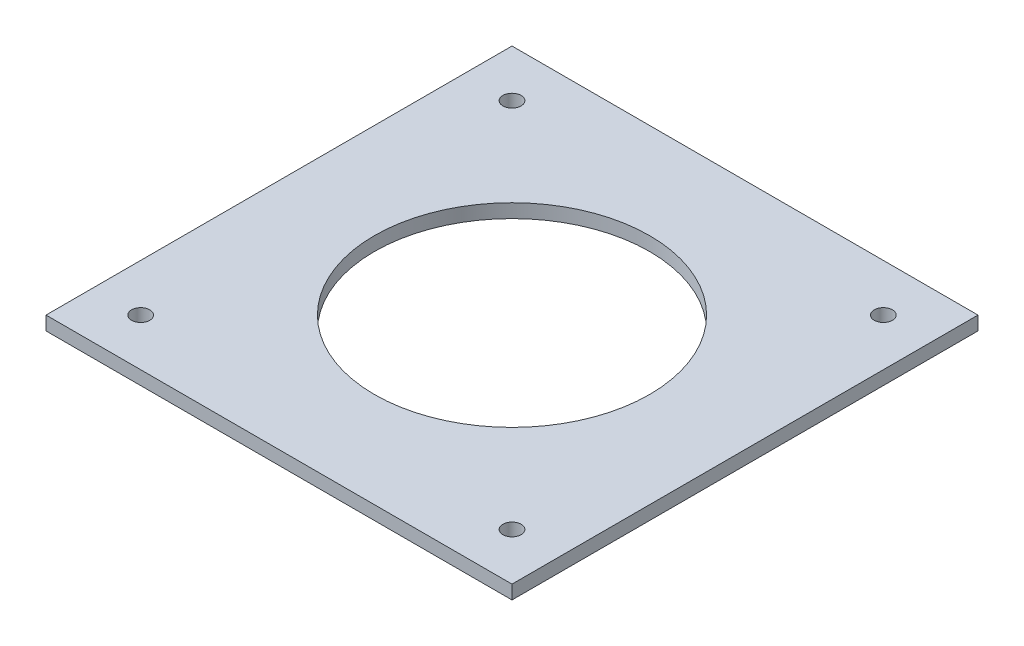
from build123d import *

# Parameters (mm, degrees)
SKETCH1_W           = 101.6
SKETCH1_H           = 101.6
SKETCH1_R           = 30
SKETCH1_R_2         = 1.985
BOSS_EXTRUDE1_DEPTH = 3


with BuildPart() as part:
    # Sketch1 → Boss-Extrude1 (new body)
    with BuildSketch(Plane(origin=(0, 0, 0), x_dir=(1, 0, 0), z_dir=(0, 1, 0))):
        Rectangle(SKETCH1_W, SKETCH1_H)
        with Locations(Location((0, 0, 0), (0, 0, 270))):
            Circle(SKETCH1_R, mode=Mode.SUBTRACT)
        with Locations(Location((-40.48, 40.48, 0), (0, 0, 270))):
            Circle(SKETCH1_R_2, mode=Mode.SUBTRACT)
        with Locations(Location((40.48, 40.48, 0), (0, 0, 270))):
            Circle(SKETCH1_R_2, mode=Mode.SUBTRACT)
        with Locations(Location((40.48, -40.48, 0), (0, 0, 270))):
            Circle(SKETCH1_R_2, mode=Mode.SUBTRACT)
        with Locations(Location((-40.48, -40.48, 0), (0, 0, 270))):
            Circle(SKETCH1_R_2, mode=Mode.SUBTRACT)
    extrude(amount=BOSS_EXTRUDE1_DEPTH)


solid = part.part
